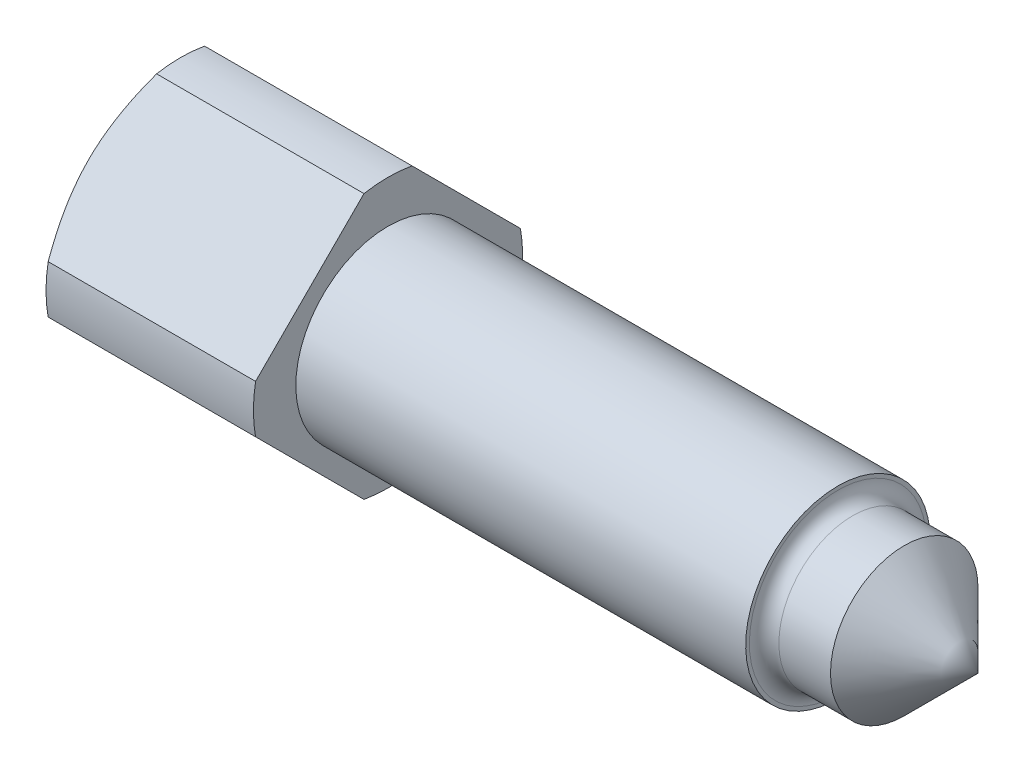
from build123d import *

# Parameters (mm, degrees)
SKETCH1_R          = 3.65
BASEHEAD_DEPTH     = 6
SKETCH2_OUTSIDE_W  = 11.688
SKETCH2_OUTSIDE_H  = 11.688
CUT_EXTRUDE1_DEPTH = 6
FILLET1_R          = 0.4


with BuildPart() as part:
    # Sketch1 → BaseHead (new body)
    with BuildSketch(Plane(origin=(0, 0, 0), x_dir=(0, 0, -1), z_dir=(1, 0, 0))):
        Circle(SKETCH1_R)
    extrude(amount=BASEHEAD_DEPTH)

    # Sketch2 outside → Cut-Extrude1 (cut)
    with BuildSketch(Plane(origin=(0, 2.662946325, -1.492108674), x_dir=(0, 0, 1), z_dir=(-1, 0, 0))):
        with Locations((1.492, -2.663)):
            Rectangle(SKETCH2_OUTSIDE_W, SKETCH2_OUTSIDE_H)
        Polygon((5.734749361, -2.662946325), (1.492108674, 1.579694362), (-2.750532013, -2.662946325), (1.492108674, -6.905587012), align=None, mode=Mode.SUBTRACT)
    extrude(amount=-CUT_EXTRUDE1_DEPTH, mode=Mode.SUBTRACT)

    # Sketch3 → Cut-Revolve1 (revolve, cut)
    with BuildSketch(Plane(origin=(1.259716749, -5.274716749, 0), x_dir=(0, -1, 0), z_dir=(0, 0, 1))):
        Polygon((-9.289716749, -1.259716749), (-8.274716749, -1.259716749), (-9.289716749, -0.673706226), align=None)
    revolve(axis=Axis((1.545283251, 0, 0), (-1, 0, 0)), mode=Mode.SUBTRACT)

    # Sketch4 → BaseBody (revolve)
    with BuildSketch(Plane(origin=(-10.34721472, 12.84721472, 0), x_dir=(0, -1, 0), z_dir=(0, 0, 1)), mode=Mode.PRIVATE) as basebody_sk:
        Polygon((12.84721472, 16.34721472), (15.34721472, 16.34721472), (15.34721472, 28.54721472), (14.84721472, 28.54721472), (14.84721472, 30.34721472), (12.84721472, 32.34721472), align=None)
    revolve(basebody_sk.sketch.rotate(Axis((14.086803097, 0, 0), (-1, 0, 0)), 180), axis=Axis((14.086803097, 0, 0), (-1, 0, 0)))

    # Fillet1
    fillet1_edges = [part.edges().sort_by_distance(p)[0] for p in [
        (18.2, -2, 0),
    ]]
    fillet(fillet1_edges, radius=FILLET1_R)


solid = part.part
